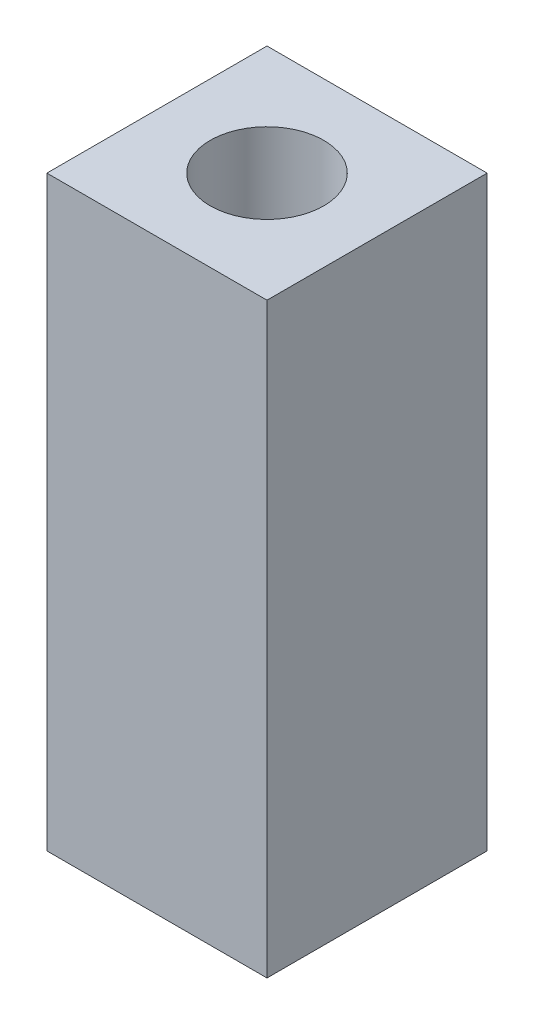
from build123d import *

# Parameters (mm, degrees)
SKETCH1_W                    = 9.525
SKETCH1_H                    = 9.525
BOSS_EXTRUDE1_DEPTH          = 25.4
F_10_0_1935_DIAMETER_HOLE1_D = 4.9149


with BuildPart() as part:
    # Sketch1 → Boss-Extrude1 (new body)
    with BuildSketch(Plane(origin=(0, 0, 0), x_dir=(1, 0, 0), z_dir=(0, 1, 0))):
        Rectangle(SKETCH1_W, SKETCH1_H)
    extrude(amount=BOSS_EXTRUDE1_DEPTH)

    # 10 _0.1935_ Diameter Hole1 (through all)
    with Locations(Plane(origin=(0, 25.4, 0), x_dir=(1, 0, 0), z_dir=(0, 1, 0))):
        with Locations((0, 0)):
            Hole(F_10_0_1935_DIAMETER_HOLE1_D / 2)


solid = part.part
